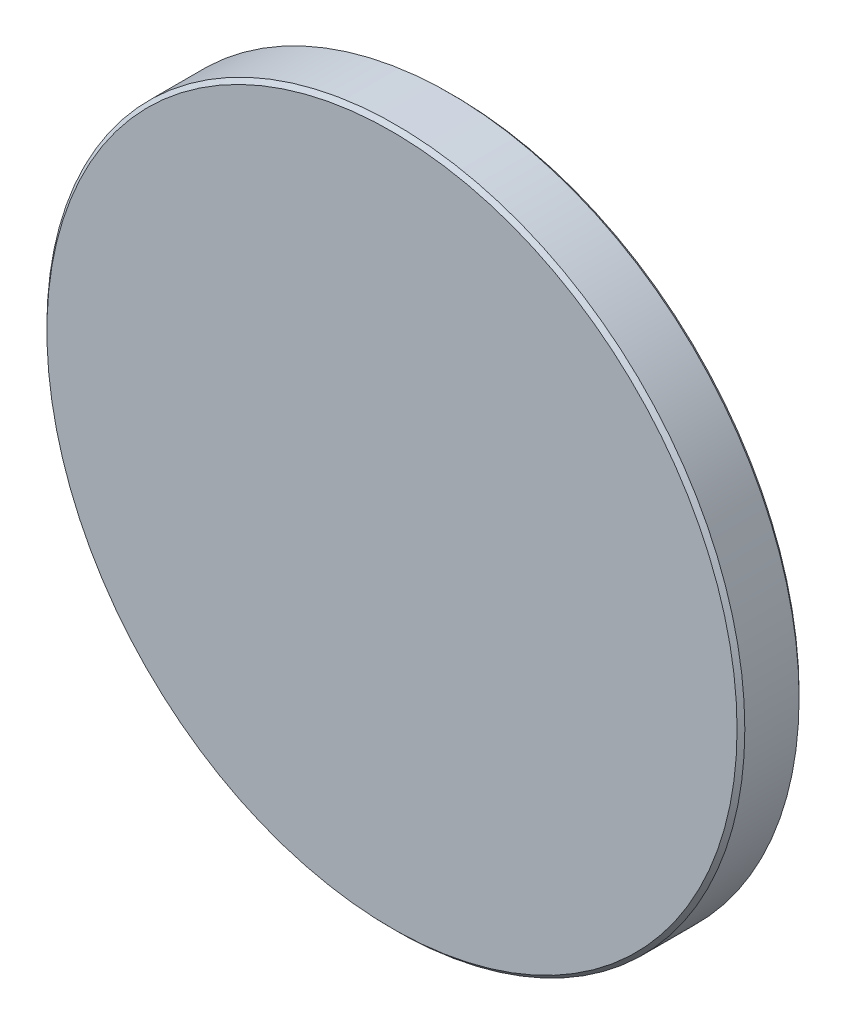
from build123d import *


with BuildPart() as part:
    # Sketch1 → Revolve1 (revolve)
    with BuildSketch(Plane(origin=(0, -18, -1.35), x_dir=(0, 0, -1), z_dir=(1, 0, 0)), mode=Mode.PRIVATE) as revolve1_sk:
        Polygon((-5.35, 18), (2.65, 18), (2.65, 62.5), (2.15, 63), (-4.85, 63), (-5.35, 62.5), align=None)
    revolve(revolve1_sk.sketch.rotate(Axis((0, 0, -4), (0, 0, -1)), 90), axis=Axis((0, 0, -4), (0, 0, -1)))


solid = part.part
